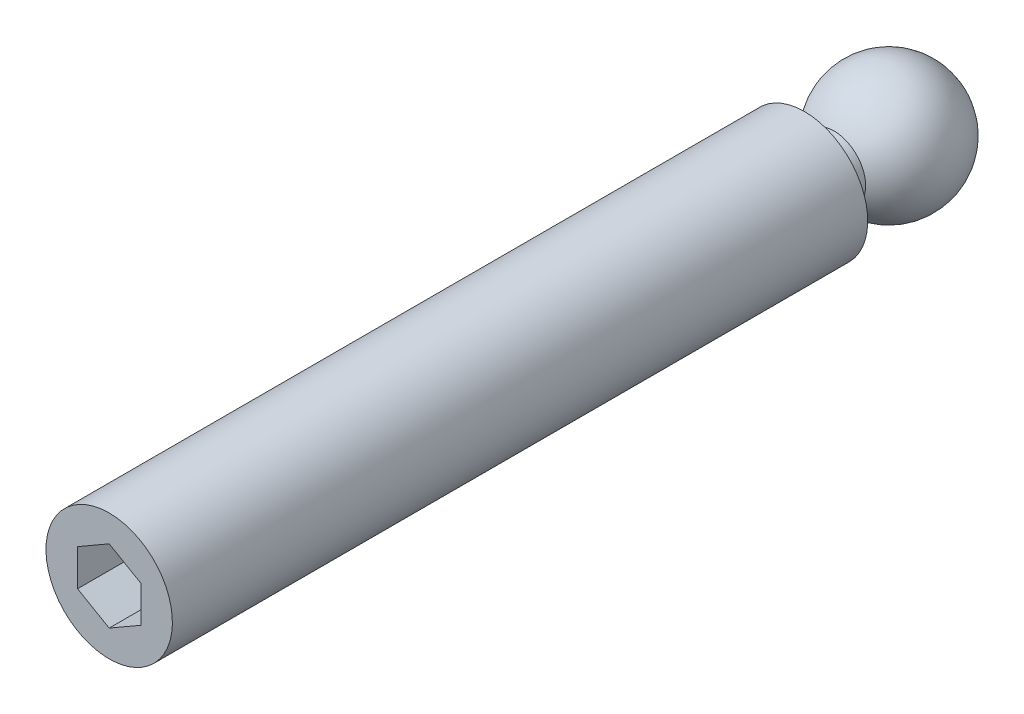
ISO-10303-21;
HEADER;
FILE_DESCRIPTION(('STEP AP214'),'2;1');
FILE_NAME('part.step','',(''),(''),'','','');
FILE_SCHEMA(('AUTOMOTIVE_DESIGN { 1 0 10303 214 1 1 1 1 }'));
ENDSEC;
DATA;
#1=APPLICATION_CONTEXT('core data for automotive mechanical design processes');
#2=APPLICATION_PROTOCOL_DEFINITION('international standard','automotive_design',2000,#1);
#3=PRODUCT_CONTEXT('',#1,'mechanical');
#4=PRODUCT('Part','Part','',(#3));
#5=PRODUCT_RELATED_PRODUCT_CATEGORY('part','',(#4));
#6=PRODUCT_DEFINITION_FORMATION('','',#4);
#7=PRODUCT_DEFINITION_CONTEXT('part definition',#1,'design');
#8=PRODUCT_DEFINITION('design','',#6,#7);
#9=PRODUCT_DEFINITION_SHAPE('','',#8);
#10=(LENGTH_UNIT() NAMED_UNIT(*) SI_UNIT(.MILLI.,.METRE.));
#11=(NAMED_UNIT(*) PLANE_ANGLE_UNIT() SI_UNIT($,.RADIAN.));
#12=(NAMED_UNIT(*) SI_UNIT($,.STERADIAN.) SOLID_ANGLE_UNIT());
#13=UNCERTAINTY_MEASURE_WITH_UNIT(LENGTH_MEASURE(1.E-05),#10,'distance_accuracy_value','');
#14=(GEOMETRIC_REPRESENTATION_CONTEXT(3) GLOBAL_UNCERTAINTY_ASSIGNED_CONTEXT((#13)) GLOBAL_UNIT_ASSIGNED_CONTEXT((#10,
#11,#12)) REPRESENTATION_CONTEXT('',''));
#15=CARTESIAN_POINT('',(0.,0.,0.));
#16=DIRECTION('',(0.,0.,1.));
#17=DIRECTION('',(1.,0.,0.));
#18=AXIS2_PLACEMENT_3D('',#15,#16,#17);
#19=CARTESIAN_POINT('',(0.,0.,3.));
#20=DIRECTION('',(0.,-1.,0.));
#21=DIRECTION('',(-1.,0.,0.));
#22=AXIS2_PLACEMENT_3D('',#19,#20,#21);
#23=SPHERICAL_SURFACE('',#22,3.);
#24=CARTESIAN_POINT('',(0.,0.,3.));
#25=DIRECTION('',(0.,0.,1.));
#26=DIRECTION('',(0.,1.,0.));
#27=AXIS2_PLACEMENT_3D('',#24,#25,#26);
#28=SPHERICAL_SURFACE('',#27,3.);
#29=CARTESIAN_POINT('',(0.,0.,5.59807621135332));
#30=DIRECTION('',(0.,0.,1.));
#31=DIRECTION('',(0.,1.,0.));
#32=AXIS2_PLACEMENT_3D('',#29,#30,#31);
#33=CIRCLE('',#32,1.5);
#34=CARTESIAN_POINT('',(0.,1.5,5.59807621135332));
#35=VERTEX_POINT('',#34);
#36=EDGE_CURVE('E9',#35,#35,#33,.T.);
#37=ORIENTED_EDGE('',*,*,#36,.F.);
#38=EDGE_LOOP('',(#37));
#39=FACE_BOUND('',#38,.T.);
#40=ADVANCED_FACE('F14',(#39),#28,.T.);
#41=CARTESIAN_POINT('',(0.,0.,30.));
#42=DIRECTION('',(0.,0.,1.));
#43=DIRECTION('',(0.,1.,0.));
#44=AXIS2_PLACEMENT_3D('',#41,#42,#43);
#45=CYLINDRICAL_SURFACE('',#44,1.5);
#46=ORIENTED_EDGE('',*,*,#36,.T.);
#47=EDGE_LOOP('',(#46));
#48=FACE_BOUND('',#47,.T.);
#49=CARTESIAN_POINT('',(0.,0.,7.));
#50=DIRECTION('',(0.,0.,1.));
#51=DIRECTION('',(0.,1.,0.));
#52=AXIS2_PLACEMENT_3D('',#49,#50,#51);
#53=CIRCLE('',#52,1.5);
#54=CARTESIAN_POINT('',(0.,1.5,7.));
#55=VERTEX_POINT('',#54);
#56=EDGE_CURVE('E21',#55,#55,#53,.T.);
#57=ORIENTED_EDGE('',*,*,#56,.F.);
#58=EDGE_LOOP('',(#57));
#59=FACE_BOUND('',#58,.T.);
#60=ADVANCED_FACE('F131',(#48,#59),#45,.T.);
#61=CARTESIAN_POINT('',(0.,-3.,7.));
#62=DIRECTION('',(0.,0.,-1.));
#63=DIRECTION('',(0.,-1.,0.));
#64=AXIS2_PLACEMENT_3D('',#61,#62,#63);
#65=PLANE('',#64);
#66=ORIENTED_EDGE('',*,*,#56,.T.);
#67=EDGE_LOOP('',(#66));
#68=FACE_BOUND('',#67,.T.);
#69=CARTESIAN_POINT('',(0.,0.,7.));
#70=DIRECTION('',(0.,0.,1.));
#71=DIRECTION('',(0.,1.,0.));
#72=AXIS2_PLACEMENT_3D('',#69,#70,#71);
#73=CIRCLE('',#72,3.);
#74=CARTESIAN_POINT('',(0.,3.,7.));
#75=VERTEX_POINT('',#74);
#76=EDGE_CURVE('E123',#75,#75,#73,.T.);
#77=ORIENTED_EDGE('',*,*,#76,.F.);
#78=EDGE_LOOP('',(#77));
#79=FACE_BOUND('',#78,.T.);
#80=ADVANCED_FACE('F128',(#68,#79),#65,.T.);
#81=CARTESIAN_POINT('',(0.,0.,30.));
#82=DIRECTION('',(0.,0.,1.));
#83=DIRECTION('',(0.,1.,0.));
#84=AXIS2_PLACEMENT_3D('',#81,#82,#83);
#85=CYLINDRICAL_SURFACE('',#84,3.);
#86=ORIENTED_EDGE('',*,*,#76,.T.);
#87=EDGE_LOOP('',(#86));
#88=FACE_BOUND('',#87,.T.);
#89=CARTESIAN_POINT('',(0.,0.,40.));
#90=DIRECTION('',(0.,0.,1.));
#91=DIRECTION('',(0.,1.,0.));
#92=AXIS2_PLACEMENT_3D('',#89,#90,#91);
#93=CIRCLE('',#92,3.);
#94=CARTESIAN_POINT('',(0.,3.,40.));
#95=VERTEX_POINT('',#94);
#96=EDGE_CURVE('E115',#95,#95,#93,.T.);
#97=ORIENTED_EDGE('',*,*,#96,.F.);
#98=EDGE_LOOP('',(#97));
#99=FACE_BOUND('',#98,.T.);
#100=ADVANCED_FACE('F139',(#88,#99),#85,.T.);
#101=CARTESIAN_POINT('',(0.,0.,40.));
#102=DIRECTION('',(0.,0.,1.));
#103=DIRECTION('',(0.,1.,0.));
#104=AXIS2_PLACEMENT_3D('',#101,#102,#103);
#105=PLANE('',#104);
#106=DIRECTION('',(-0.866025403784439,0.5,0.));
#107=VECTOR('',#106,1.);
#108=CARTESIAN_POINT('',(1.5,0.86602540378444,40.));
#109=LINE('',#108,#107);
#110=CARTESIAN_POINT('',(1.5,0.86602540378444,40.));
#111=VERTEX_POINT('',#110);
#112=CARTESIAN_POINT('',(0.,1.73205080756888,40.));
#113=VERTEX_POINT('',#112);
#114=EDGE_CURVE('E28',#111,#113,#109,.T.);
#115=ORIENTED_EDGE('',*,*,#114,.F.);
#116=DIRECTION('',(0.,1.,0.));
#117=VECTOR('',#116,1.);
#118=CARTESIAN_POINT('',(1.5,-0.866025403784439,40.));
#119=LINE('',#118,#117);
#120=CARTESIAN_POINT('',(1.5,-0.866025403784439,40.));
#121=VERTEX_POINT('',#120);
#122=EDGE_CURVE('E111',#121,#111,#119,.T.);
#123=ORIENTED_EDGE('',*,*,#122,.F.);
#124=DIRECTION('',(0.866025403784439,0.5,0.));
#125=VECTOR('',#124,1.);
#126=CARTESIAN_POINT('',(0.,-1.73205080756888,40.));
#127=LINE('',#126,#125);
#128=CARTESIAN_POINT('',(0.,-1.73205080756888,40.));
#129=VERTEX_POINT('',#128);
#130=EDGE_CURVE('E109',#129,#121,#127,.T.);
#131=ORIENTED_EDGE('',*,*,#130,.F.);
#132=DIRECTION('',(0.866025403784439,-0.5,0.));
#133=VECTOR('',#132,1.);
#134=CARTESIAN_POINT('',(-1.5,-0.866025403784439,40.));
#135=LINE('',#134,#133);
#136=CARTESIAN_POINT('',(-1.5,-0.866025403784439,40.));
#137=VERTEX_POINT('',#136);
#138=EDGE_CURVE('E76',#137,#129,#135,.T.);
#139=ORIENTED_EDGE('',*,*,#138,.F.);
#140=DIRECTION('',(0.,-1.,0.));
#141=VECTOR('',#140,1.);
#142=CARTESIAN_POINT('',(-1.5,0.866025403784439,40.));
#143=LINE('',#142,#141);
#144=CARTESIAN_POINT('',(-1.5,0.866025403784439,40.));
#145=VERTEX_POINT('',#144);
#146=EDGE_CURVE('E105',#145,#137,#143,.T.);
#147=ORIENTED_EDGE('',*,*,#146,.F.);
#148=DIRECTION('',(-0.866025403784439,-0.5,0.));
#149=VECTOR('',#148,1.);
#150=CARTESIAN_POINT('',(0.,1.73205080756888,40.));
#151=LINE('',#150,#149);
#152=EDGE_CURVE('E102',#113,#145,#151,.T.);
#153=ORIENTED_EDGE('',*,*,#152,.F.);
#154=EDGE_LOOP('',(#115,#123,#131,#139,#147,#153));
#155=FACE_BOUND('',#154,.T.);
#156=ORIENTED_EDGE('',*,*,#96,.T.);
#157=EDGE_LOOP('',(#156));
#158=FACE_BOUND('',#157,.T.);
#159=ADVANCED_FACE('F145',(#155,#158),#105,.T.);
#160=CARTESIAN_POINT('',(1.5,0.86602540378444,36.));
#161=DIRECTION('',(0.5,0.866025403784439,0.));
#162=DIRECTION('',(-0.866025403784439,0.5,0.));
#163=AXIS2_PLACEMENT_3D('',#160,#161,#162);
#164=PLANE('',#163);
#165=ORIENTED_EDGE('',*,*,#114,.T.);
#166=DIRECTION('',(0.,0.,1.));
#167=VECTOR('',#166,1.);
#168=CARTESIAN_POINT('',(0.,1.73205080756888,36.));
#169=LINE('',#168,#167);
#170=CARTESIAN_POINT('',(0.,1.73205080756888,36.));
#171=VERTEX_POINT('',#170);
#172=EDGE_CURVE('E58',#171,#113,#169,.T.);
#173=ORIENTED_EDGE('',*,*,#172,.F.);
#174=DIRECTION('',(-0.866025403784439,0.5,0.));
#175=VECTOR('',#174,1.);
#176=CARTESIAN_POINT('',(1.5,0.86602540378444,36.));
#177=LINE('',#176,#175);
#178=CARTESIAN_POINT('',(1.5,0.86602540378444,36.));
#179=VERTEX_POINT('',#178);
#180=EDGE_CURVE('E113',#179,#171,#177,.T.);
#181=ORIENTED_EDGE('',*,*,#180,.F.);
#182=DIRECTION('',(0.,0.,1.));
#183=VECTOR('',#182,1.);
#184=CARTESIAN_POINT('',(1.5,0.86602540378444,36.));
#185=LINE('',#184,#183);
#186=EDGE_CURVE('E36',#179,#111,#185,.T.);
#187=ORIENTED_EDGE('',*,*,#186,.T.);
#188=EDGE_LOOP('',(#165,#173,#181,#187));
#189=FACE_BOUND('',#188,.T.);
#190=ADVANCED_FACE('F149',(#189),#164,.F.);
#191=CARTESIAN_POINT('',(1.5,-0.866025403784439,36.));
#192=DIRECTION('',(1.,0.,0.));
#193=DIRECTION('',(0.,0.,-1.));
#194=AXIS2_PLACEMENT_3D('',#191,#192,#193);
#195=PLANE('',#194);
#196=ORIENTED_EDGE('',*,*,#122,.T.);
#197=ORIENTED_EDGE('',*,*,#186,.F.);
#198=DIRECTION('',(0.,1.,0.));
#199=VECTOR('',#198,1.);
#200=CARTESIAN_POINT('',(1.5,-0.866025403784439,36.));
#201=LINE('',#200,#199);
#202=CARTESIAN_POINT('',(1.5,-0.866025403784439,36.));
#203=VERTEX_POINT('',#202);
#204=EDGE_CURVE('E88',#203,#179,#201,.T.);
#205=ORIENTED_EDGE('',*,*,#204,.F.);
#206=DIRECTION('',(0.,0.,1.));
#207=VECTOR('',#206,1.);
#208=CARTESIAN_POINT('',(1.5,-0.866025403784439,36.));
#209=LINE('',#208,#207);
#210=EDGE_CURVE('E80',#203,#121,#209,.T.);
#211=ORIENTED_EDGE('',*,*,#210,.T.);
#212=EDGE_LOOP('',(#196,#197,#205,#211));
#213=FACE_BOUND('',#212,.T.);
#214=ADVANCED_FACE('F153',(#213),#195,.F.);
#215=CARTESIAN_POINT('',(0.,-1.73205080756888,36.));
#216=DIRECTION('',(0.5,-0.866025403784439,0.));
#217=DIRECTION('',(0.866025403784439,0.5,0.));
#218=AXIS2_PLACEMENT_3D('',#215,#216,#217);
#219=PLANE('',#218);
#220=ORIENTED_EDGE('',*,*,#130,.T.);
#221=ORIENTED_EDGE('',*,*,#210,.F.);
#222=DIRECTION('',(0.866025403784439,0.5,0.));
#223=VECTOR('',#222,1.);
#224=CARTESIAN_POINT('',(0.,-1.73205080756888,36.));
#225=LINE('',#224,#223);
#226=CARTESIAN_POINT('',(0.,-1.73205080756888,36.));
#227=VERTEX_POINT('',#226);
#228=EDGE_CURVE('E84',#227,#203,#225,.T.);
#229=ORIENTED_EDGE('',*,*,#228,.F.);
#230=DIRECTION('',(0.,0.,1.));
#231=VECTOR('',#230,1.);
#232=CARTESIAN_POINT('',(0.,-1.73205080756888,36.));
#233=LINE('',#232,#231);
#234=EDGE_CURVE('E69',#227,#129,#233,.T.);
#235=ORIENTED_EDGE('',*,*,#234,.T.);
#236=EDGE_LOOP('',(#220,#221,#229,#235));
#237=FACE_BOUND('',#236,.T.);
#238=ADVANCED_FACE('F85',(#237),#219,.F.);
#239=CARTESIAN_POINT('',(-1.5,-0.866025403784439,36.));
#240=DIRECTION('',(-0.5,-0.866025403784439,0.));
#241=DIRECTION('',(0.866025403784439,-0.5,0.));
#242=AXIS2_PLACEMENT_3D('',#239,#240,#241);
#243=PLANE('',#242);
#244=ORIENTED_EDGE('',*,*,#138,.T.);
#245=ORIENTED_EDGE('',*,*,#234,.F.);
#246=DIRECTION('',(0.866025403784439,-0.5,0.));
#247=VECTOR('',#246,1.);
#248=CARTESIAN_POINT('',(-1.5,-0.866025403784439,36.));
#249=LINE('',#248,#247);
#250=CARTESIAN_POINT('',(-1.5,-0.866025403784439,36.));
#251=VERTEX_POINT('',#250);
#252=EDGE_CURVE('E73',#251,#227,#249,.T.);
#253=ORIENTED_EDGE('',*,*,#252,.F.);
#254=DIRECTION('',(0.,0.,1.));
#255=VECTOR('',#254,1.);
#256=CARTESIAN_POINT('',(-1.5,-0.866025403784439,36.));
#257=LINE('',#256,#255);
#258=EDGE_CURVE('E81',#251,#137,#257,.T.);
#259=ORIENTED_EDGE('',*,*,#258,.T.);
#260=EDGE_LOOP('',(#244,#245,#253,#259));
#261=FACE_BOUND('',#260,.T.);
#262=ADVANCED_FACE('F71',(#261),#243,.F.);
#263=CARTESIAN_POINT('',(-1.5,0.866025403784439,36.));
#264=DIRECTION('',(-1.,0.,0.));
#265=DIRECTION('',(0.,-1.,0.));
#266=AXIS2_PLACEMENT_3D('',#263,#264,#265);
#267=PLANE('',#266);
#268=ORIENTED_EDGE('',*,*,#146,.T.);
#269=ORIENTED_EDGE('',*,*,#258,.F.);
#270=DIRECTION('',(0.,-1.,0.));
#271=VECTOR('',#270,1.);
#272=CARTESIAN_POINT('',(-1.5,0.866025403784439,36.));
#273=LINE('',#272,#271);
#274=CARTESIAN_POINT('',(-1.5,0.866025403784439,36.));
#275=VERTEX_POINT('',#274);
#276=EDGE_CURVE('E94',#275,#251,#273,.T.);
#277=ORIENTED_EDGE('',*,*,#276,.F.);
#278=DIRECTION('',(0.,0.,1.));
#279=VECTOR('',#278,1.);
#280=CARTESIAN_POINT('',(-1.5,0.866025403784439,36.));
#281=LINE('',#280,#279);
#282=EDGE_CURVE('E118',#275,#145,#281,.T.);
#283=ORIENTED_EDGE('',*,*,#282,.T.);
#284=EDGE_LOOP('',(#268,#269,#277,#283));
#285=FACE_BOUND('',#284,.T.);
#286=ADVANCED_FACE('F157',(#285),#267,.F.);
#287=CARTESIAN_POINT('',(0.,1.73205080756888,36.));
#288=DIRECTION('',(-0.5,0.866025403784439,0.));
#289=DIRECTION('',(-0.866025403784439,-0.5,0.));
#290=AXIS2_PLACEMENT_3D('',#287,#288,#289);
#291=PLANE('',#290);
#292=ORIENTED_EDGE('',*,*,#152,.T.);
#293=ORIENTED_EDGE('',*,*,#282,.F.);
#294=DIRECTION('',(-0.866025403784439,-0.5,0.));
#295=VECTOR('',#294,1.);
#296=CARTESIAN_POINT('',(0.,1.73205080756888,36.));
#297=LINE('',#296,#295);
#298=EDGE_CURVE('E96',#171,#275,#297,.T.);
#299=ORIENTED_EDGE('',*,*,#298,.F.);
#300=ORIENTED_EDGE('',*,*,#172,.T.);
#301=EDGE_LOOP('',(#292,#293,#299,#300));
#302=FACE_BOUND('',#301,.T.);
#303=ADVANCED_FACE('F154',(#302),#291,.F.);
#304=CARTESIAN_POINT('',(0.,1.73205080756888,36.));
#305=DIRECTION('',(0.,0.,1.));
#306=DIRECTION('',(1.,0.,0.));
#307=AXIS2_PLACEMENT_3D('',#304,#305,#306);
#308=PLANE('',#307);
#309=ORIENTED_EDGE('',*,*,#180,.T.);
#310=ORIENTED_EDGE('',*,*,#298,.T.);
#311=ORIENTED_EDGE('',*,*,#276,.T.);
#312=ORIENTED_EDGE('',*,*,#252,.T.);
#313=ORIENTED_EDGE('',*,*,#228,.T.);
#314=ORIENTED_EDGE('',*,*,#204,.T.);
#315=EDGE_LOOP('',(#309,#310,#311,#312,#313,#314));
#316=FACE_BOUND('',#315,.T.);
#317=ADVANCED_FACE('F91',(#316),#308,.T.);
#318=CLOSED_SHELL('',(#40,#60,#80,#100,#159,#190,#214,#238,#262,#286,#303,#317));
#319=MANIFOLD_SOLID_BREP('B1',#318);
#320=ADVANCED_BREP_SHAPE_REPRESENTATION('',(#18,#319),#14);
#321=SHAPE_DEFINITION_REPRESENTATION(#9,#320);
ENDSEC;
END-ISO-10303-21;
